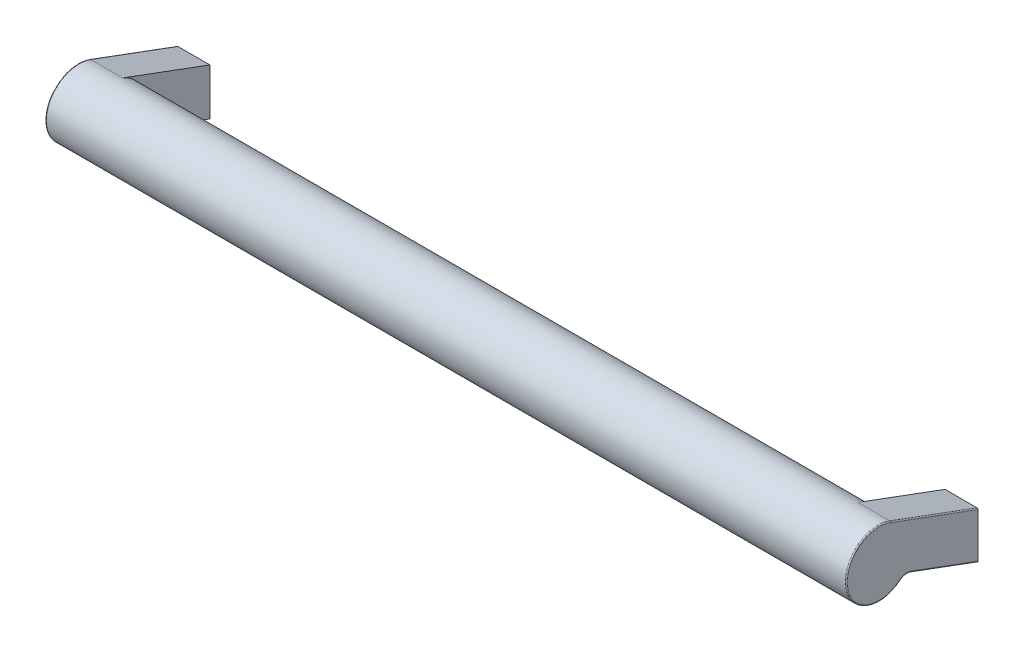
ISO-10303-21;
HEADER;
FILE_DESCRIPTION(('STEP AP214'),'2;1');
FILE_NAME('part.step','',(''),(''),'','','');
FILE_SCHEMA(('AUTOMOTIVE_DESIGN { 1 0 10303 214 1 1 1 1 }'));
ENDSEC;
DATA;
#1=APPLICATION_CONTEXT('core data for automotive mechanical design processes');
#2=APPLICATION_PROTOCOL_DEFINITION('international standard','automotive_design',2000,#1);
#3=PRODUCT_CONTEXT('',#1,'mechanical');
#4=PRODUCT('Part','Part','',(#3));
#5=PRODUCT_RELATED_PRODUCT_CATEGORY('part','',(#4));
#6=PRODUCT_DEFINITION_FORMATION('','',#4);
#7=PRODUCT_DEFINITION_CONTEXT('part definition',#1,'design');
#8=PRODUCT_DEFINITION('design','',#6,#7);
#9=PRODUCT_DEFINITION_SHAPE('','',#8);
#10=(LENGTH_UNIT() NAMED_UNIT(*) SI_UNIT(.MILLI.,.METRE.));
#11=(NAMED_UNIT(*) PLANE_ANGLE_UNIT() SI_UNIT($,.RADIAN.));
#12=(NAMED_UNIT(*) SI_UNIT($,.STERADIAN.) SOLID_ANGLE_UNIT());
#13=UNCERTAINTY_MEASURE_WITH_UNIT(LENGTH_MEASURE(1.E-05),#10,'distance_accuracy_value','');
#14=(GEOMETRIC_REPRESENTATION_CONTEXT(3) GLOBAL_UNCERTAINTY_ASSIGNED_CONTEXT((#13)) GLOBAL_UNIT_ASSIGNED_CONTEXT((#10,
#11,#12)) REPRESENTATION_CONTEXT('',''));
#15=CARTESIAN_POINT('',(0.,0.,0.));
#16=DIRECTION('',(0.,0.,1.));
#17=DIRECTION('',(1.,0.,0.));
#18=AXIS2_PLACEMENT_3D('',#15,#16,#17);
#19=CARTESIAN_POINT('',(142.5,11.,45.));
#20=DIRECTION('',(1.,0.,0.));
#21=DIRECTION('',(0.,1.,0.));
#22=AXIS2_PLACEMENT_3D('',#19,#20,#21);
#23=CYLINDRICAL_SURFACE('',#22,15.);
#24=CARTESIAN_POINT('',(7.5,11.,45.));
#25=DIRECTION('',(1.,0.,0.));
#26=DIRECTION('',(0.,1.,0.));
#27=AXIS2_PLACEMENT_3D('',#24,#25,#26);
#28=CIRCLE('',#27,15.);
#29=CARTESIAN_POINT('',(7.5,-0.545116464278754,35.4234512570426));
#30=VERTEX_POINT('',#29);
#31=CARTESIAN_POINT('',(7.5,25.0660927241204,39.7899102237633));
#32=VERTEX_POINT('',#31);
#33=EDGE_CURVE('E9',#30,#32,#28,.T.);
#34=ORIENTED_EDGE('',*,*,#33,.T.);
#35=DIRECTION('',(1.,0.,0.));
#36=VECTOR('',#35,1.);
#37=CARTESIAN_POINT('',(-7.5,25.0660927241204,39.7899102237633));
#38=LINE('',#37,#36);
#39=CARTESIAN_POINT('',(-7.,25.0660927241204,39.7899102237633));
#40=VERTEX_POINT('',#39);
#41=EDGE_CURVE('E373',#32,#40,#38,.F.);
#42=ORIENTED_EDGE('',*,*,#41,.T.);
#43=CARTESIAN_POINT('',(-7.,11.,45.));
#44=DIRECTION('',(1.,0.,0.));
#45=DIRECTION('',(0.,1.,0.));
#46=AXIS2_PLACEMENT_3D('',#43,#44,#45);
#47=CIRCLE('',#46,15.);
#48=CARTESIAN_POINT('',(-7.,-0.545116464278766,35.4234512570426));
#49=VERTEX_POINT('',#48);
#50=EDGE_CURVE('E354',#49,#40,#47,.F.);
#51=ORIENTED_EDGE('',*,*,#50,.F.);
#52=DIRECTION('',(1.,0.,0.));
#53=VECTOR('',#52,1.);
#54=CARTESIAN_POINT('',(-7.5,-0.545116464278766,35.4234512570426));
#55=LINE('',#54,#53);
#56=EDGE_CURVE('E372',#49,#30,#55,.T.);
#57=ORIENTED_EDGE('',*,*,#56,.T.);
#58=EDGE_LOOP('',(#34,#42,#51,#57));
#59=FACE_BOUND('',#58,.T.);
#60=DIRECTION('',(1.,0.,0.));
#61=VECTOR('',#60,1.);
#62=CARTESIAN_POINT('',(342.5,-0.545116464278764,35.4234512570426));
#63=LINE('',#62,#61);
#64=CARTESIAN_POINT('',(342.5,-0.545116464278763,35.4234512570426));
#65=VERTEX_POINT('',#64);
#66=CARTESIAN_POINT('',(357.,-0.545116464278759,35.4234512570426));
#67=VERTEX_POINT('',#66);
#68=EDGE_CURVE('E139',#65,#67,#63,.T.);
#69=ORIENTED_EDGE('',*,*,#68,.T.);
#70=CARTESIAN_POINT('',(357.,11.,45.));
#71=DIRECTION('',(1.,0.,0.));
#72=DIRECTION('',(0.,1.,0.));
#73=AXIS2_PLACEMENT_3D('',#70,#71,#72);
#74=CIRCLE('',#73,15.);
#75=CARTESIAN_POINT('',(357.,25.0660927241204,39.7899102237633));
#76=VERTEX_POINT('',#75);
#77=EDGE_CURVE('E166',#76,#67,#74,.T.);
#78=ORIENTED_EDGE('',*,*,#77,.F.);
#79=DIRECTION('',(1.,0.,0.));
#80=VECTOR('',#79,1.);
#81=CARTESIAN_POINT('',(342.5,25.0660927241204,39.7899102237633));
#82=LINE('',#81,#80);
#83=CARTESIAN_POINT('',(342.5,25.0660927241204,39.7899102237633));
#84=VERTEX_POINT('',#83);
#85=EDGE_CURVE('E142',#76,#84,#82,.F.);
#86=ORIENTED_EDGE('',*,*,#85,.T.);
#87=CARTESIAN_POINT('',(342.5,11.,45.));
#88=DIRECTION('',(1.,0.,0.));
#89=DIRECTION('',(0.,1.,0.));
#90=AXIS2_PLACEMENT_3D('',#87,#88,#89);
#91=CIRCLE('',#90,15.);
#92=EDGE_CURVE('E136',#65,#84,#91,.T.);
#93=ORIENTED_EDGE('',*,*,#92,.F.);
#94=EDGE_LOOP('',(#69,#78,#86,#93));
#95=FACE_BOUND('',#94,.T.);
#96=ADVANCED_FACE('F14',(#59,#95),#23,.T.);
#97=CARTESIAN_POINT('',(0.,0.,9.));
#98=DIRECTION('',(0.,0.,-1.));
#99=DIRECTION('',(1.,0.,0.));
#100=AXIS2_PLACEMENT_3D('',#97,#98,#99);
#101=PLANE('',#100);
#102=CARTESIAN_POINT('',(0.,0.,9.));
#103=DIRECTION('',(0.,0.,-1.));
#104=DIRECTION('',(1.,0.,0.));
#105=AXIS2_PLACEMENT_3D('',#102,#103,#104);
#106=CIRCLE('',#105,3.);
#107=CARTESIAN_POINT('',(3.,0.,9.));
#108=VERTEX_POINT('',#107);
#109=EDGE_CURVE('E208',#108,#108,#106,.T.);
#110=ORIENTED_EDGE('',*,*,#109,.T.);
#111=EDGE_LOOP('',(#110));
#112=FACE_BOUND('',#111,.T.);
#113=ADVANCED_FACE('F431',(#112),#101,.T.);
#114=CARTESIAN_POINT('',(-7.5,-4.39348861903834,32.2312683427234));
#115=DIRECTION('',(1.,0.,0.));
#116=DIRECTION('',(0.,1.,0.));
#117=AXIS2_PLACEMENT_3D('',#114,#115,#116);
#118=PLANE('',#117);
#119=CARTESIAN_POINT('',(-7.5,11.,45.));
#120=DIRECTION('',(1.,0.,0.));
#121=DIRECTION('',(0.,1.,0.));
#122=AXIS2_PLACEMENT_3D('',#119,#120,#121);
#123=CIRCLE('',#122,14.5);
#124=CARTESIAN_POINT('',(-7.5,25.5,45.));
#125=VERTEX_POINT('',#124);
#126=CARTESIAN_POINT('',(-7.5,-3.5,45.));
#127=VERTEX_POINT('',#126);
#128=EDGE_CURVE('E314',#125,#127,#123,.T.);
#129=ORIENTED_EDGE('',*,*,#128,.F.);
#130=CARTESIAN_POINT('',(-7.5,11.,45.));
#131=DIRECTION('',(1.,0.,0.));
#132=DIRECTION('',(0.,0.937739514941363,-0.347339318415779));
#133=AXIS2_PLACEMENT_3D('',#130,#131,#132);
#134=CIRCLE('',#133,14.5);
#135=CARTESIAN_POINT('',(-7.5,24.5972229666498,39.9635798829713));
#136=VERTEX_POINT('',#135);
#137=EDGE_CURVE('E302',#136,#125,#134,.T.);
#138=ORIENTED_EDGE('',*,*,#137,.F.);
#139=DIRECTION('',(0.,0.347339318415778,0.937739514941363));
#140=VECTOR('',#139,1.);
#141=CARTESIAN_POINT('',(-7.5,9.79468731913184,0.));
#142=LINE('',#141,#140);
#143=CARTESIAN_POINT('',(-7.5,9.79468731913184,0.));
#144=VERTEX_POINT('',#143);
#145=EDGE_CURVE('E328',#144,#136,#142,.T.);
#146=ORIENTED_EDGE('',*,*,#145,.F.);
#147=DIRECTION('',(0.,1.,0.));
#148=VECTOR('',#147,1.);
#149=CARTESIAN_POINT('',(-7.5,-4.39348861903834,0.));
#150=LINE('',#149,#148);
#151=CARTESIAN_POINT('',(-7.5,-10.466802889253,0.));
#152=VERTEX_POINT('',#151);
#153=EDGE_CURVE('E335',#152,#144,#150,.T.);
#154=ORIENTED_EDGE('',*,*,#153,.F.);
#155=DIRECTION('',(0.,-0.347339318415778,-0.937739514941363));
#156=VECTOR('',#155,1.);
#157=CARTESIAN_POINT('',(-7.5,0.764078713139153,30.3209020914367));
#158=LINE('',#157,#156);
#159=CARTESIAN_POINT('',(-7.5,0.764078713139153,30.3209020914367));
#160=VERTEX_POINT('',#159);
#161=EDGE_CURVE('E338',#160,#152,#158,.T.);
#162=ORIENTED_EDGE('',*,*,#161,.F.);
#163=CARTESIAN_POINT('',(-7.5,-4.39348861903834,32.2312683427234));
#164=DIRECTION('',(-1.,0.,0.));
#165=DIRECTION('',(0.,1.,0.));
#166=AXIS2_PLACEMENT_3D('',#163,#164,#165);
#167=CIRCLE('',#166,5.5);
#168=CARTESIAN_POINT('',(-7.5,1.10651138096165,32.2312683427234));
#169=VERTEX_POINT('',#168);
#170=EDGE_CURVE('E290',#169,#160,#167,.T.);
#171=ORIENTED_EDGE('',*,*,#170,.F.);
#172=CARTESIAN_POINT('',(-7.5,-4.39348861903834,32.2312683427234));
#173=DIRECTION('',(-1.,0.,0.));
#174=DIRECTION('',(0.,0.769674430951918,0.638436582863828));
#175=AXIS2_PLACEMENT_3D('',#172,#173,#174);
#176=CIRCLE('',#175,5.5);
#177=CARTESIAN_POINT('',(-7.5,-0.160279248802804,35.7426695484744));
#178=VERTEX_POINT('',#177);
#179=EDGE_CURVE('E249',#178,#169,#176,.T.);
#180=ORIENTED_EDGE('',*,*,#179,.F.);
#181=CARTESIAN_POINT('',(-7.5,11.,45.));
#182=DIRECTION('',(1.,0.,0.));
#183=DIRECTION('',(0.,-1.,0.));
#184=AXIS2_PLACEMENT_3D('',#181,#182,#183);
#185=CIRCLE('',#184,14.5);
#186=EDGE_CURVE('E21',#127,#178,#185,.T.);
#187=ORIENTED_EDGE('',*,*,#186,.F.);
#188=EDGE_LOOP('',(#129,#138,#146,#154,#162,#171,#180,#187));
#189=FACE_BOUND('',#188,.T.);
#190=ADVANCED_FACE('F268',(#189),#118,.F.);
#191=CARTESIAN_POINT('',(0.,0.,9.));
#192=DIRECTION('',(0.,0.,-1.));
#193=DIRECTION('',(1.,0.,0.));
#194=AXIS2_PLACEMENT_3D('',#191,#192,#193);
#195=CYLINDRICAL_SURFACE('',#194,3.);
#196=ORIENTED_EDGE('',*,*,#109,.F.);
#197=EDGE_LOOP('',(#196));
#198=FACE_BOUND('',#197,.T.);
#199=CARTESIAN_POINT('',(0.,0.,0.));
#200=DIRECTION('',(0.,0.,-1.));
#201=DIRECTION('',(1.,0.,0.));
#202=AXIS2_PLACEMENT_3D('',#199,#200,#201);
#203=CIRCLE('',#202,3.);
#204=CARTESIAN_POINT('',(3.,0.,0.));
#205=VERTEX_POINT('',#204);
#206=EDGE_CURVE('E205',#205,#205,#203,.T.);
#207=ORIENTED_EDGE('',*,*,#206,.T.);
#208=EDGE_LOOP('',(#207));
#209=FACE_BOUND('',#208,.T.);
#210=ADVANCED_FACE('F435',(#198,#209),#195,.F.);
#211=CARTESIAN_POINT('',(-7.,0.764078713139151,30.3209020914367));
#212=DIRECTION('',(0.,0.347339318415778,0.937739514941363));
#213=DIRECTION('',(0.,0.937739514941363,-0.347339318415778));
#214=AXIS2_PLACEMENT_3D('',#211,#212,#213);
#215=CYLINDRICAL_SURFACE('',#214,0.5);
#216=CARTESIAN_POINT('',(-7.,0.764078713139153,30.3209020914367));
#217=DIRECTION('',(0.,0.347339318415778,0.937739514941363));
#218=DIRECTION('',(0.,0.937739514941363,-0.347339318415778));
#219=AXIS2_PLACEMENT_3D('',#216,#217,#218);
#220=CIRCLE('',#219,0.5);
#221=CARTESIAN_POINT('',(-7.,0.29520895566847,30.4945717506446));
#222=VERTEX_POINT('',#221);
#223=EDGE_CURVE('E364',#222,#160,#220,.F.);
#224=ORIENTED_EDGE('',*,*,#223,.T.);
#225=ORIENTED_EDGE('',*,*,#161,.T.);
#226=CARTESIAN_POINT('',(-7.,-10.466802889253,0.));
#227=DIRECTION('',(0.,0.,1.));
#228=DIRECTION('',(0.,1.,0.));
#229=AXIS2_PLACEMENT_3D('',#226,#227,#228);
#230=ELLIPSE('',#229,0.53319711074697,0.5);
#231=CARTESIAN_POINT('',(-7.,-11.,0.));
#232=VERTEX_POINT('',#231);
#233=EDGE_CURVE('E366',#152,#232,#230,.T.);
#234=ORIENTED_EDGE('',*,*,#233,.T.);
#235=DIRECTION('',(0.,0.347339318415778,0.937739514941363));
#236=VECTOR('',#235,1.);
#237=CARTESIAN_POINT('',(-7.,0.295208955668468,30.4945717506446));
#238=LINE('',#237,#236);
#239=EDGE_CURVE('E217',#232,#222,#238,.T.);
#240=ORIENTED_EDGE('',*,*,#239,.T.);
#241=EDGE_LOOP('',(#224,#225,#234,#240));
#242=FACE_BOUND('',#241,.T.);
#243=ADVANCED_FACE('F226',(#242),#215,.T.);
#244=CARTESIAN_POINT('',(-7.,-4.39348861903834,32.2312683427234));
#245=DIRECTION('',(1.,0.,0.));
#246=DIRECTION('',(0.,1.,0.));
#247=AXIS2_PLACEMENT_3D('',#244,#245,#246);
#248=TOROIDAL_SURFACE('',#247,5.49999999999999,0.5);
#249=ORIENTED_EDGE('',*,*,#170,.T.);
#250=ORIENTED_EDGE('',*,*,#223,.F.);
#251=CARTESIAN_POINT('',(-7.,-4.39348861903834,32.2312683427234));
#252=DIRECTION('',(1.,0.,0.));
#253=DIRECTION('',(0.,1.,0.));
#254=AXIS2_PLACEMENT_3D('',#251,#252,#253);
#255=CIRCLE('',#254,5.);
#256=EDGE_CURVE('E382',#222,#49,#255,.T.);
#257=ORIENTED_EDGE('',*,*,#256,.T.);
#258=CARTESIAN_POINT('',(-7.,-0.160279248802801,35.7426695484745));
#259=DIRECTION('',(0.,0.638436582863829,-0.769674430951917));
#260=DIRECTION('',(0.,-0.769674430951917,-0.638436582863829));
#261=AXIS2_PLACEMENT_3D('',#258,#259,#260);
#262=CIRCLE('',#261,0.5);
#263=EDGE_CURVE('E347',#178,#49,#262,.F.);
#264=ORIENTED_EDGE('',*,*,#263,.F.);
#265=ORIENTED_EDGE('',*,*,#179,.T.);
#266=EDGE_LOOP('',(#249,#250,#257,#264,#265));
#267=FACE_BOUND('',#266,.T.);
#268=ADVANCED_FACE('F220',(#267),#248,.T.);
#269=CARTESIAN_POINT('',(-7.,18.5811294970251,23.7214550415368));
#270=DIRECTION('',(0.,-0.347339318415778,-0.937739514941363));
#271=DIRECTION('',(0.,-0.937739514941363,0.347339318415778));
#272=AXIS2_PLACEMENT_3D('',#269,#270,#271);
#273=CYLINDRICAL_SURFACE('',#272,0.5);
#274=CARTESIAN_POINT('',(-7.,9.79468731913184,0.));
#275=DIRECTION('',(0.,0.,1.));
#276=DIRECTION('',(0.,-1.,0.));
#277=AXIS2_PLACEMENT_3D('',#274,#275,#276);
#278=ELLIPSE('',#277,0.533197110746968,0.5);
#279=CARTESIAN_POINT('',(-7.,10.3278844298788,0.));
#280=VERTEX_POINT('',#279);
#281=EDGE_CURVE('E359',#280,#144,#278,.T.);
#282=ORIENTED_EDGE('',*,*,#281,.T.);
#283=ORIENTED_EDGE('',*,*,#145,.T.);
#284=CARTESIAN_POINT('',(-7.,24.5972229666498,39.9635798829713));
#285=DIRECTION('',(0.,0.347339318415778,0.937739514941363));
#286=DIRECTION('',(0.,0.937739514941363,-0.347339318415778));
#287=AXIS2_PLACEMENT_3D('',#284,#285,#286);
#288=CIRCLE('',#287,0.5);
#289=EDGE_CURVE('E355',#40,#136,#288,.T.);
#290=ORIENTED_EDGE('',*,*,#289,.F.);
#291=DIRECTION('',(0.,-0.347339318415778,-0.937739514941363));
#292=VECTOR('',#291,1.);
#293=CARTESIAN_POINT('',(-7.,19.0499992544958,23.547785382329));
#294=LINE('',#293,#292);
#295=EDGE_CURVE('E276',#40,#280,#294,.T.);
#296=ORIENTED_EDGE('',*,*,#295,.T.);
#297=EDGE_LOOP('',(#282,#283,#290,#296));
#298=FACE_BOUND('',#297,.T.);
#299=ADVANCED_FACE('F225',(#298),#273,.T.);
#300=CARTESIAN_POINT('',(-7.,11.,45.));
#301=DIRECTION('',(1.,0.,0.));
#302=DIRECTION('',(0.,1.,0.));
#303=AXIS2_PLACEMENT_3D('',#300,#301,#302);
#304=TOROIDAL_SURFACE('',#303,14.5,0.5);
#305=ORIENTED_EDGE('',*,*,#263,.T.);
#306=ORIENTED_EDGE('',*,*,#50,.T.);
#307=ORIENTED_EDGE('',*,*,#289,.T.);
#308=ORIENTED_EDGE('',*,*,#137,.T.);
#309=ORIENTED_EDGE('',*,*,#128,.T.);
#310=ORIENTED_EDGE('',*,*,#186,.T.);
#311=EDGE_LOOP('',(#305,#306,#307,#308,#309,#310));
#312=FACE_BOUND('',#311,.T.);
#313=ADVANCED_FACE('F256',(#312),#304,.T.);
#314=CARTESIAN_POINT('',(-7.5,10.3278844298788,0.));
#315=DIRECTION('',(0.,0.,1.));
#316=DIRECTION('',(-1.,0.,0.));
#317=AXIS2_PLACEMENT_3D('',#314,#315,#316);
#318=PLANE('',#317);
#319=ORIENTED_EDGE('',*,*,#206,.F.);
#320=EDGE_LOOP('',(#319));
#321=FACE_BOUND('',#320,.T.);
#322=ORIENTED_EDGE('',*,*,#281,.F.);
#323=DIRECTION('',(-1.,0.,0.));
#324=VECTOR('',#323,1.);
#325=CARTESIAN_POINT('',(-7.5,10.3278844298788,0.));
#326=LINE('',#325,#324);
#327=CARTESIAN_POINT('',(7.5,10.3278844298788,0.));
#328=VERTEX_POINT('',#327);
#329=EDGE_CURVE('E380',#328,#280,#326,.T.);
#330=ORIENTED_EDGE('',*,*,#329,.F.);
#331=DIRECTION('',(0.,-1.,0.));
#332=VECTOR('',#331,1.);
#333=CARTESIAN_POINT('',(7.5,10.3278844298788,0.));
#334=LINE('',#333,#332);
#335=CARTESIAN_POINT('',(7.5,-11.,0.));
#336=VERTEX_POINT('',#335);
#337=EDGE_CURVE('E377',#336,#328,#334,.F.);
#338=ORIENTED_EDGE('',*,*,#337,.F.);
#339=DIRECTION('',(-1.,0.,0.));
#340=VECTOR('',#339,1.);
#341=CARTESIAN_POINT('',(-7.5,-11.,0.));
#342=LINE('',#341,#340);
#343=EDGE_CURVE('E381',#232,#336,#342,.F.);
#344=ORIENTED_EDGE('',*,*,#343,.F.);
#345=ORIENTED_EDGE('',*,*,#233,.F.);
#346=ORIENTED_EDGE('',*,*,#153,.T.);
#347=EDGE_LOOP('',(#322,#330,#338,#344,#345,#346));
#348=FACE_BOUND('',#347,.T.);
#349=ADVANCED_FACE('F266',(#321,#348),#318,.F.);
#350=CARTESIAN_POINT('',(-7.5,-11.,0.));
#351=DIRECTION('',(0.,0.937739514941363,-0.347339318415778));
#352=DIRECTION('',(0.,-0.347339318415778,-0.937739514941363));
#353=AXIS2_PLACEMENT_3D('',#350,#351,#352);
#354=PLANE('',#353);
#355=ORIENTED_EDGE('',*,*,#239,.F.);
#356=ORIENTED_EDGE('',*,*,#343,.T.);
#357=DIRECTION('',(0.,-0.347339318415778,-0.937739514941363));
#358=VECTOR('',#357,1.);
#359=CARTESIAN_POINT('',(7.5,0.29520895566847,30.4945717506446));
#360=LINE('',#359,#358);
#361=CARTESIAN_POINT('',(7.5,0.29520895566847,30.4945717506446));
#362=VERTEX_POINT('',#361);
#363=EDGE_CURVE('E212',#362,#336,#360,.T.);
#364=ORIENTED_EDGE('',*,*,#363,.F.);
#365=DIRECTION('',(-1.,0.,0.));
#366=VECTOR('',#365,1.);
#367=CARTESIAN_POINT('',(-7.5,0.29520895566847,30.4945717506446));
#368=LINE('',#367,#366);
#369=EDGE_CURVE('E211',#222,#362,#368,.F.);
#370=ORIENTED_EDGE('',*,*,#369,.F.);
#371=EDGE_LOOP('',(#355,#356,#364,#370));
#372=FACE_BOUND('',#371,.T.);
#373=ADVANCED_FACE('F417',(#372),#354,.F.);
#374=CARTESIAN_POINT('',(-7.5,-4.39348861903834,32.2312683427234));
#375=DIRECTION('',(1.,0.,0.));
#376=DIRECTION('',(0.,1.,0.));
#377=AXIS2_PLACEMENT_3D('',#374,#375,#376);
#378=CYLINDRICAL_SURFACE('',#377,5.);
#379=ORIENTED_EDGE('',*,*,#256,.F.);
#380=ORIENTED_EDGE('',*,*,#369,.T.);
#381=CARTESIAN_POINT('',(7.5,-4.39348861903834,32.2312683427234));
#382=DIRECTION('',(1.,0.,0.));
#383=DIRECTION('',(0.,1.,0.));
#384=AXIS2_PLACEMENT_3D('',#381,#382,#383);
#385=CIRCLE('',#384,5.);
#386=EDGE_CURVE('E214',#30,#362,#385,.F.);
#387=ORIENTED_EDGE('',*,*,#386,.F.);
#388=ORIENTED_EDGE('',*,*,#56,.F.);
#389=EDGE_LOOP('',(#379,#380,#387,#388));
#390=FACE_BOUND('',#389,.T.);
#391=ADVANCED_FACE('F414',(#390),#378,.F.);
#392=CARTESIAN_POINT('',(-7.5,10.3278844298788,0.));
#393=DIRECTION('',(0.,-0.937739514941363,0.347339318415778));
#394=DIRECTION('',(0.,0.347339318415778,0.937739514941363));
#395=AXIS2_PLACEMENT_3D('',#392,#393,#394);
#396=PLANE('',#395);
#397=ORIENTED_EDGE('',*,*,#295,.F.);
#398=ORIENTED_EDGE('',*,*,#41,.F.);
#399=DIRECTION('',(0.,0.347339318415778,0.937739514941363));
#400=VECTOR('',#399,1.);
#401=CARTESIAN_POINT('',(7.5,10.3278844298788,0.));
#402=LINE('',#401,#400);
#403=EDGE_CURVE('E375',#328,#32,#402,.T.);
#404=ORIENTED_EDGE('',*,*,#403,.F.);
#405=ORIENTED_EDGE('',*,*,#329,.T.);
#406=EDGE_LOOP('',(#397,#398,#404,#405));
#407=FACE_BOUND('',#406,.T.);
#408=ADVANCED_FACE('F228',(#407),#396,.F.);
#409=CARTESIAN_POINT('',(7.5,-4.39348861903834,32.2312683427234));
#410=DIRECTION('',(1.,0.,0.));
#411=DIRECTION('',(0.,1.,0.));
#412=AXIS2_PLACEMENT_3D('',#409,#410,#411);
#413=PLANE('',#412);
#414=ORIENTED_EDGE('',*,*,#403,.T.);
#415=ORIENTED_EDGE('',*,*,#33,.F.);
#416=ORIENTED_EDGE('',*,*,#386,.T.);
#417=ORIENTED_EDGE('',*,*,#363,.T.);
#418=ORIENTED_EDGE('',*,*,#337,.T.);
#419=EDGE_LOOP('',(#414,#415,#416,#417,#418));
#420=FACE_BOUND('',#419,.T.);
#421=ADVANCED_FACE('F418',(#420),#413,.T.);
#422=CARTESIAN_POINT('',(350.,0.,9.));
#423=DIRECTION('',(0.,0.,-1.));
#424=DIRECTION('',(1.,0.,0.));
#425=AXIS2_PLACEMENT_3D('',#422,#423,#424);
#426=PLANE('',#425);
#427=CARTESIAN_POINT('',(350.,0.,9.));
#428=DIRECTION('',(0.,0.,-1.));
#429=DIRECTION('',(1.,0.,0.));
#430=AXIS2_PLACEMENT_3D('',#427,#428,#429);
#431=CIRCLE('',#430,3.);
#432=CARTESIAN_POINT('',(353.,0.,9.));
#433=VERTEX_POINT('',#432);
#434=EDGE_CURVE('E154',#433,#433,#431,.T.);
#435=ORIENTED_EDGE('',*,*,#434,.T.);
#436=EDGE_LOOP('',(#435));
#437=FACE_BOUND('',#436,.T.);
#438=ADVANCED_FACE('F420',(#437),#426,.T.);
#439=CARTESIAN_POINT('',(350.,0.,9.));
#440=DIRECTION('',(0.,0.,-1.));
#441=DIRECTION('',(1.,0.,0.));
#442=AXIS2_PLACEMENT_3D('',#439,#440,#441);
#443=CYLINDRICAL_SURFACE('',#442,3.);
#444=ORIENTED_EDGE('',*,*,#434,.F.);
#445=EDGE_LOOP('',(#444));
#446=FACE_BOUND('',#445,.T.);
#447=CARTESIAN_POINT('',(350.,0.,0.));
#448=DIRECTION('',(0.,0.,-1.));
#449=DIRECTION('',(1.,0.,0.));
#450=AXIS2_PLACEMENT_3D('',#447,#448,#449);
#451=CIRCLE('',#450,3.);
#452=CARTESIAN_POINT('',(353.,0.,0.));
#453=VERTEX_POINT('',#452);
#454=EDGE_CURVE('E202',#453,#453,#451,.T.);
#455=ORIENTED_EDGE('',*,*,#454,.T.);
#456=EDGE_LOOP('',(#455));
#457=FACE_BOUND('',#456,.T.);
#458=ADVANCED_FACE('F426',(#446,#457),#443,.F.);
#459=CARTESIAN_POINT('',(357.,-10.5311302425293,-0.173669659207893));
#460=DIRECTION('',(0.,-0.347339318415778,-0.937739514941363));
#461=DIRECTION('',(0.,-0.937739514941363,0.347339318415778));
#462=AXIS2_PLACEMENT_3D('',#459,#460,#461);
#463=CYLINDRICAL_SURFACE('',#462,0.5);
#464=CARTESIAN_POINT('',(357.,0.764078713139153,30.3209020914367));
#465=DIRECTION('',(0.,-0.347339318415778,-0.937739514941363));
#466=DIRECTION('',(0.,-0.937739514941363,0.347339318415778));
#467=AXIS2_PLACEMENT_3D('',#464,#465,#466);
#468=CIRCLE('',#467,0.5);
#469=CARTESIAN_POINT('',(357.5,0.764078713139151,30.3209020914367));
#470=VERTEX_POINT('',#469);
#471=CARTESIAN_POINT('',(357.,0.29520895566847,30.4945717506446));
#472=VERTEX_POINT('',#471);
#473=EDGE_CURVE('E162',#470,#472,#468,.T.);
#474=ORIENTED_EDGE('',*,*,#473,.T.);
#475=DIRECTION('',(0.,-0.347339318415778,-0.937739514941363));
#476=VECTOR('',#475,1.);
#477=CARTESIAN_POINT('',(357.,-11.,0.));
#478=LINE('',#477,#476);
#479=CARTESIAN_POINT('',(357.,-11.,0.));
#480=VERTEX_POINT('',#479);
#481=EDGE_CURVE('E198',#472,#480,#478,.T.);
#482=ORIENTED_EDGE('',*,*,#481,.T.);
#483=CARTESIAN_POINT('',(357.,-10.466802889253,0.));
#484=DIRECTION('',(0.,0.,1.));
#485=DIRECTION('',(0.,-1.,0.));
#486=AXIS2_PLACEMENT_3D('',#483,#484,#485);
#487=ELLIPSE('',#486,0.53319711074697,0.5);
#488=CARTESIAN_POINT('',(357.5,-10.466802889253,0.));
#489=VERTEX_POINT('',#488);
#490=EDGE_CURVE('E594',#480,#489,#487,.T.);
#491=ORIENTED_EDGE('',*,*,#490,.T.);
#492=DIRECTION('',(0.,-0.347339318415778,-0.937739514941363));
#493=VECTOR('',#492,1.);
#494=CARTESIAN_POINT('',(357.5,0.764078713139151,30.3209020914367));
#495=LINE('',#494,#493);
#496=EDGE_CURVE('E617',#470,#489,#495,.T.);
#497=ORIENTED_EDGE('',*,*,#496,.F.);
#498=EDGE_LOOP('',(#474,#482,#491,#497));
#499=FACE_BOUND('',#498,.T.);
#500=ADVANCED_FACE('F190',(#499),#463,.T.);
#501=CARTESIAN_POINT('',(342.5,10.3278844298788,0.));
#502=DIRECTION('',(0.,0.,1.));
#503=DIRECTION('',(-1.,0.,0.));
#504=AXIS2_PLACEMENT_3D('',#501,#502,#503);
#505=PLANE('',#504);
#506=ORIENTED_EDGE('',*,*,#454,.F.);
#507=EDGE_LOOP('',(#506));
#508=FACE_BOUND('',#507,.T.);
#509=ORIENTED_EDGE('',*,*,#490,.F.);
#510=DIRECTION('',(-1.,0.,0.));
#511=VECTOR('',#510,1.);
#512=CARTESIAN_POINT('',(342.5,-11.,0.));
#513=LINE('',#512,#511);
#514=CARTESIAN_POINT('',(342.5,-11.,0.));
#515=VERTEX_POINT('',#514);
#516=EDGE_CURVE('E593',#515,#480,#513,.F.);
#517=ORIENTED_EDGE('',*,*,#516,.F.);
#518=DIRECTION('',(0.,-1.,0.));
#519=VECTOR('',#518,1.);
#520=CARTESIAN_POINT('',(342.5,10.3278844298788,0.));
#521=LINE('',#520,#519);
#522=CARTESIAN_POINT('',(342.5,10.3278844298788,0.));
#523=VERTEX_POINT('',#522);
#524=EDGE_CURVE('E592',#523,#515,#521,.T.);
#525=ORIENTED_EDGE('',*,*,#524,.F.);
#526=DIRECTION('',(-1.,0.,0.));
#527=VECTOR('',#526,1.);
#528=CARTESIAN_POINT('',(342.5,10.3278844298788,0.));
#529=LINE('',#528,#527);
#530=CARTESIAN_POINT('',(357.,10.3278844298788,0.));
#531=VERTEX_POINT('',#530);
#532=EDGE_CURVE('E590',#531,#523,#529,.T.);
#533=ORIENTED_EDGE('',*,*,#532,.F.);
#534=CARTESIAN_POINT('',(357.,9.79468731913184,0.));
#535=DIRECTION('',(0.,0.,1.));
#536=DIRECTION('',(0.,1.,0.));
#537=AXIS2_PLACEMENT_3D('',#534,#535,#536);
#538=ELLIPSE('',#537,0.533197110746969,0.5);
#539=CARTESIAN_POINT('',(357.5,9.79468731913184,0.));
#540=VERTEX_POINT('',#539);
#541=EDGE_CURVE('E589',#540,#531,#538,.T.);
#542=ORIENTED_EDGE('',*,*,#541,.F.);
#543=DIRECTION('',(0.,1.,0.));
#544=VECTOR('',#543,1.);
#545=CARTESIAN_POINT('',(357.5,-4.39348861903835,0.));
#546=LINE('',#545,#544);
#547=EDGE_CURVE('E613',#489,#540,#546,.T.);
#548=ORIENTED_EDGE('',*,*,#547,.F.);
#549=EDGE_LOOP('',(#509,#517,#525,#533,#542,#548));
#550=FACE_BOUND('',#549,.T.);
#551=ADVANCED_FACE('F495',(#508,#550),#505,.F.);
#552=CARTESIAN_POINT('',(357.,9.85901467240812,0.173669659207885));
#553=DIRECTION('',(0.,0.347339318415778,0.937739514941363));
#554=DIRECTION('',(0.,0.937739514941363,-0.347339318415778));
#555=AXIS2_PLACEMENT_3D('',#552,#553,#554);
#556=CYLINDRICAL_SURFACE('',#555,0.5);
#557=CARTESIAN_POINT('',(357.,24.5972229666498,39.9635798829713));
#558=DIRECTION('',(0.,0.347339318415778,0.937739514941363));
#559=DIRECTION('',(0.,0.937739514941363,-0.347339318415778));
#560=AXIS2_PLACEMENT_3D('',#557,#558,#559);
#561=CIRCLE('',#560,0.5);
#562=CARTESIAN_POINT('',(357.5,24.5972229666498,39.9635798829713));
#563=VERTEX_POINT('',#562);
#564=EDGE_CURVE('E169',#563,#76,#561,.T.);
#565=ORIENTED_EDGE('',*,*,#564,.F.);
#566=DIRECTION('',(0.,0.347339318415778,0.937739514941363));
#567=VECTOR('',#566,1.);
#568=CARTESIAN_POINT('',(357.5,9.79468731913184,0.));
#569=LINE('',#568,#567);
#570=EDGE_CURVE('E618',#540,#563,#569,.T.);
#571=ORIENTED_EDGE('',*,*,#570,.F.);
#572=ORIENTED_EDGE('',*,*,#541,.T.);
#573=DIRECTION('',(0.,0.347339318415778,0.937739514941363));
#574=VECTOR('',#573,1.);
#575=CARTESIAN_POINT('',(357.,10.3278844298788,0.));
#576=LINE('',#575,#574);
#577=EDGE_CURVE('E586',#531,#76,#576,.T.);
#578=ORIENTED_EDGE('',*,*,#577,.T.);
#579=EDGE_LOOP('',(#565,#571,#572,#578));
#580=FACE_BOUND('',#579,.T.);
#581=ADVANCED_FACE('F504',(#580),#556,.T.);
#582=CARTESIAN_POINT('',(357.5,-4.39348861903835,32.2312683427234));
#583=DIRECTION('',(1.,0.,0.));
#584=DIRECTION('',(0.,1.,0.));
#585=AXIS2_PLACEMENT_3D('',#582,#583,#584);
#586=PLANE('',#585);
#587=CARTESIAN_POINT('',(357.5,11.,45.));
#588=DIRECTION('',(-1.,0.,0.));
#589=DIRECTION('',(0.,-1.,0.));
#590=AXIS2_PLACEMENT_3D('',#587,#588,#589);
#591=CIRCLE('',#590,14.5);
#592=CARTESIAN_POINT('',(357.5,25.5,45.));
#593=VERTEX_POINT('',#592);
#594=CARTESIAN_POINT('',(357.5,-3.5,45.));
#595=VERTEX_POINT('',#594);
#596=EDGE_CURVE('E655',#593,#595,#591,.F.);
#597=ORIENTED_EDGE('',*,*,#596,.T.);
#598=CARTESIAN_POINT('',(357.5,11.,45.));
#599=DIRECTION('',(-1.,0.,0.));
#600=DIRECTION('',(0.,-0.769674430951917,-0.638436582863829));
#601=AXIS2_PLACEMENT_3D('',#598,#599,#600);
#602=CIRCLE('',#601,14.5);
#603=CARTESIAN_POINT('',(357.5,-0.160279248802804,35.7426695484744));
#604=VERTEX_POINT('',#603);
#605=EDGE_CURVE('E145',#595,#604,#602,.F.);
#606=ORIENTED_EDGE('',*,*,#605,.T.);
#607=CARTESIAN_POINT('',(357.5,-4.39348861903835,32.2312683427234));
#608=DIRECTION('',(1.,0.,0.));
#609=DIRECTION('',(0.,1.,0.));
#610=AXIS2_PLACEMENT_3D('',#607,#608,#609);
#611=CIRCLE('',#610,5.5);
#612=CARTESIAN_POINT('',(357.5,1.10651138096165,32.2312683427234));
#613=VERTEX_POINT('',#612);
#614=EDGE_CURVE('E626',#604,#613,#611,.F.);
#615=ORIENTED_EDGE('',*,*,#614,.T.);
#616=CARTESIAN_POINT('',(357.5,-4.39348861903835,32.2312683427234));
#617=DIRECTION('',(1.,0.,0.));
#618=DIRECTION('',(0.,0.937739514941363,-0.347339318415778));
#619=AXIS2_PLACEMENT_3D('',#616,#617,#618);
#620=CIRCLE('',#619,5.5);
#621=EDGE_CURVE('E622',#613,#470,#620,.F.);
#622=ORIENTED_EDGE('',*,*,#621,.T.);
#623=ORIENTED_EDGE('',*,*,#496,.T.);
#624=ORIENTED_EDGE('',*,*,#547,.T.);
#625=ORIENTED_EDGE('',*,*,#570,.T.);
#626=CARTESIAN_POINT('',(357.5,11.,45.));
#627=DIRECTION('',(-1.,0.,0.));
#628=DIRECTION('',(0.,1.,0.));
#629=AXIS2_PLACEMENT_3D('',#626,#627,#628);
#630=CIRCLE('',#629,14.5);
#631=EDGE_CURVE('E634',#563,#593,#630,.F.);
#632=ORIENTED_EDGE('',*,*,#631,.T.);
#633=EDGE_LOOP('',(#597,#606,#615,#622,#623,#624,#625,#632));
#634=FACE_BOUND('',#633,.T.);
#635=ADVANCED_FACE('F188',(#634),#586,.T.);
#636=CARTESIAN_POINT('',(357.,-4.39348861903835,32.2312683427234));
#637=DIRECTION('',(1.,0.,0.));
#638=DIRECTION('',(0.,1.,0.));
#639=AXIS2_PLACEMENT_3D('',#636,#637,#638);
#640=TOROIDAL_SURFACE('',#639,5.5,0.5);
#641=CARTESIAN_POINT('',(357.,-4.39348861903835,32.2312683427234));
#642=DIRECTION('',(1.,0.,0.));
#643=DIRECTION('',(0.,1.,0.));
#644=AXIS2_PLACEMENT_3D('',#641,#642,#643);
#645=CIRCLE('',#644,5.);
#646=EDGE_CURVE('E158',#67,#472,#645,.F.);
#647=ORIENTED_EDGE('',*,*,#646,.T.);
#648=ORIENTED_EDGE('',*,*,#473,.F.);
#649=ORIENTED_EDGE('',*,*,#621,.F.);
#650=ORIENTED_EDGE('',*,*,#614,.F.);
#651=CARTESIAN_POINT('',(357.,-0.160279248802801,35.7426695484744));
#652=DIRECTION('',(0.,0.638436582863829,-0.769674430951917));
#653=DIRECTION('',(0.,-0.769674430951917,-0.638436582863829));
#654=AXIS2_PLACEMENT_3D('',#651,#652,#653);
#655=CIRCLE('',#654,0.5);
#656=EDGE_CURVE('E170',#67,#604,#655,.F.);
#657=ORIENTED_EDGE('',*,*,#656,.F.);
#658=EDGE_LOOP('',(#647,#648,#649,#650,#657));
#659=FACE_BOUND('',#658,.T.);
#660=ADVANCED_FACE('F176',(#659),#640,.T.);
#661=CARTESIAN_POINT('',(342.5,-11.,0.));
#662=DIRECTION('',(0.,0.937739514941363,-0.347339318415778));
#663=DIRECTION('',(0.,-0.347339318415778,-0.937739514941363));
#664=AXIS2_PLACEMENT_3D('',#661,#662,#663);
#665=PLANE('',#664);
#666=ORIENTED_EDGE('',*,*,#481,.F.);
#667=DIRECTION('',(-1.,0.,0.));
#668=VECTOR('',#667,1.);
#669=CARTESIAN_POINT('',(342.5,0.29520895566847,30.4945717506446));
#670=LINE('',#669,#668);
#671=CARTESIAN_POINT('',(342.5,0.29520895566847,30.4945717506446));
#672=VERTEX_POINT('',#671);
#673=EDGE_CURVE('E607',#672,#472,#670,.F.);
#674=ORIENTED_EDGE('',*,*,#673,.F.);
#675=DIRECTION('',(0.,-0.347339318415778,-0.937739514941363));
#676=VECTOR('',#675,1.);
#677=CARTESIAN_POINT('',(342.5,-11.,0.));
#678=LINE('',#677,#676);
#679=EDGE_CURVE('E151',#515,#672,#678,.F.);
#680=ORIENTED_EDGE('',*,*,#679,.F.);
#681=ORIENTED_EDGE('',*,*,#516,.T.);
#682=EDGE_LOOP('',(#666,#674,#680,#681));
#683=FACE_BOUND('',#682,.T.);
#684=ADVANCED_FACE('F187',(#683),#665,.F.);
#685=CARTESIAN_POINT('',(342.5,-4.39348861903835,32.2312683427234));
#686=DIRECTION('',(1.,0.,0.));
#687=DIRECTION('',(0.,1.,0.));
#688=AXIS2_PLACEMENT_3D('',#685,#686,#687);
#689=PLANE('',#688);
#690=CARTESIAN_POINT('',(342.5,-4.39348861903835,32.2312683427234));
#691=DIRECTION('',(1.,0.,0.));
#692=DIRECTION('',(0.,1.,0.));
#693=AXIS2_PLACEMENT_3D('',#690,#691,#692);
#694=CIRCLE('',#693,5.);
#695=EDGE_CURVE('E148',#65,#672,#694,.F.);
#696=ORIENTED_EDGE('',*,*,#695,.F.);
#697=ORIENTED_EDGE('',*,*,#92,.T.);
#698=DIRECTION('',(0.,0.347339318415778,0.937739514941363));
#699=VECTOR('',#698,1.);
#700=CARTESIAN_POINT('',(342.5,10.3278844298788,0.));
#701=LINE('',#700,#699);
#702=EDGE_CURVE('E160',#84,#523,#701,.F.);
#703=ORIENTED_EDGE('',*,*,#702,.T.);
#704=ORIENTED_EDGE('',*,*,#524,.T.);
#705=ORIENTED_EDGE('',*,*,#679,.T.);
#706=EDGE_LOOP('',(#696,#697,#703,#704,#705));
#707=FACE_BOUND('',#706,.T.);
#708=ADVANCED_FACE('F149',(#707),#689,.F.);
#709=CARTESIAN_POINT('',(342.5,10.3278844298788,0.));
#710=DIRECTION('',(0.,-0.937739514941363,0.347339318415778));
#711=DIRECTION('',(0.,0.347339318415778,0.937739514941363));
#712=AXIS2_PLACEMENT_3D('',#709,#710,#711);
#713=PLANE('',#712);
#714=ORIENTED_EDGE('',*,*,#577,.F.);
#715=ORIENTED_EDGE('',*,*,#532,.T.);
#716=ORIENTED_EDGE('',*,*,#702,.F.);
#717=ORIENTED_EDGE('',*,*,#85,.F.);
#718=EDGE_LOOP('',(#714,#715,#716,#717));
#719=FACE_BOUND('',#718,.T.);
#720=ADVANCED_FACE('F192',(#719),#713,.F.);
#721=CARTESIAN_POINT('',(357.,11.,45.));
#722=DIRECTION('',(1.,0.,0.));
#723=DIRECTION('',(0.,1.,0.));
#724=AXIS2_PLACEMENT_3D('',#721,#722,#723);
#725=TOROIDAL_SURFACE('',#724,14.5,0.5);
#726=ORIENTED_EDGE('',*,*,#656,.T.);
#727=ORIENTED_EDGE('',*,*,#605,.F.);
#728=ORIENTED_EDGE('',*,*,#596,.F.);
#729=ORIENTED_EDGE('',*,*,#631,.F.);
#730=ORIENTED_EDGE('',*,*,#564,.T.);
#731=ORIENTED_EDGE('',*,*,#77,.T.);
#732=EDGE_LOOP('',(#726,#727,#728,#729,#730,#731));
#733=FACE_BOUND('',#732,.T.);
#734=ADVANCED_FACE('F553',(#733),#725,.T.);
#735=CARTESIAN_POINT('',(342.5,-4.39348861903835,32.2312683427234));
#736=DIRECTION('',(1.,0.,0.));
#737=DIRECTION('',(0.,1.,0.));
#738=AXIS2_PLACEMENT_3D('',#735,#736,#737);
#739=CYLINDRICAL_SURFACE('',#738,5.);
#740=ORIENTED_EDGE('',*,*,#695,.T.);
#741=ORIENTED_EDGE('',*,*,#673,.T.);
#742=ORIENTED_EDGE('',*,*,#646,.F.);
#743=ORIENTED_EDGE('',*,*,#68,.F.);
#744=EDGE_LOOP('',(#740,#741,#742,#743));
#745=FACE_BOUND('',#744,.T.);
#746=ADVANCED_FACE('F156',(#745),#739,.F.);
#747=CLOSED_SHELL('',(#96,#113,#190,#210,#243,#268,#299,#313,#349,#373,#391,#408,#421,#438,#458,
#500,#551,#581,#635,#660,#684,#708,#720,#734,#746));
#748=MANIFOLD_SOLID_BREP('B1',#747);
#749=ADVANCED_BREP_SHAPE_REPRESENTATION('',(#18,#748),#14);
#750=SHAPE_DEFINITION_REPRESENTATION(#9,#749);
ENDSEC;
END-ISO-10303-21;
